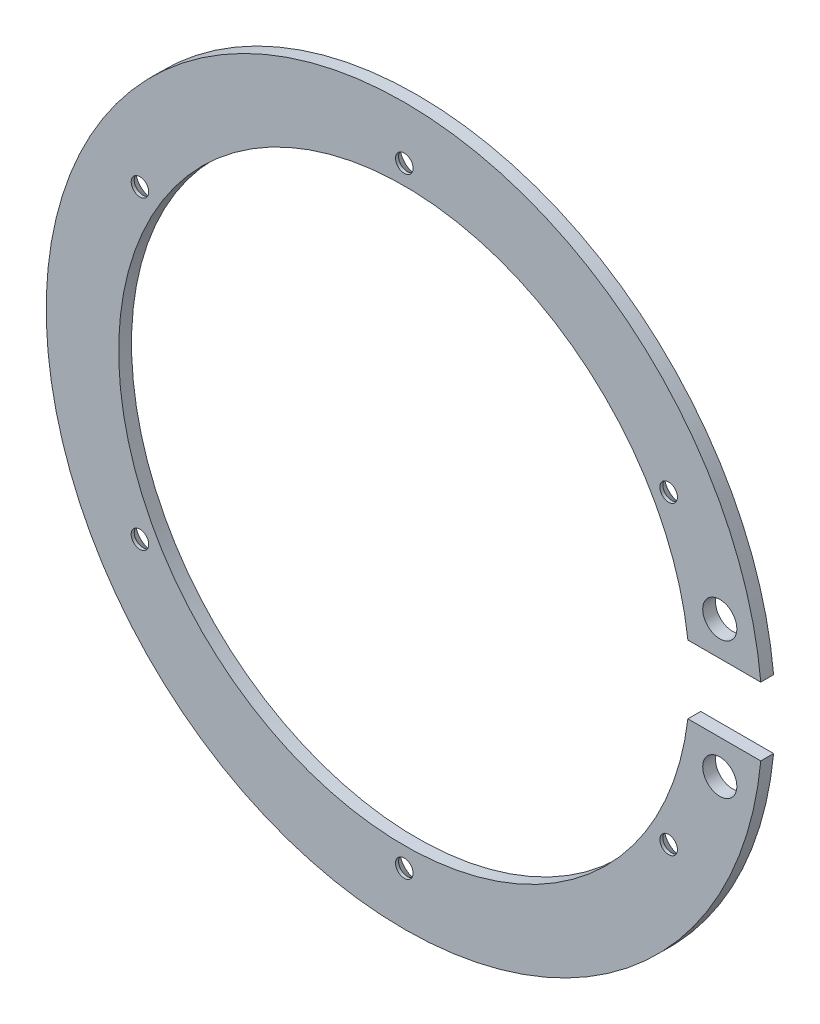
ISO-10303-21;
HEADER;
FILE_DESCRIPTION(('STEP AP214'),'2;1');
FILE_NAME('part.step','',(''),(''),'','','');
FILE_SCHEMA(('AUTOMOTIVE_DESIGN { 1 0 10303 214 1 1 1 1 }'));
ENDSEC;
DATA;
#1=APPLICATION_CONTEXT('core data for automotive mechanical design processes');
#2=APPLICATION_PROTOCOL_DEFINITION('international standard','automotive_design',2000,#1);
#3=PRODUCT_CONTEXT('',#1,'mechanical');
#4=PRODUCT('Part','Part','',(#3));
#5=PRODUCT_RELATED_PRODUCT_CATEGORY('part','',(#4));
#6=PRODUCT_DEFINITION_FORMATION('','',#4);
#7=PRODUCT_DEFINITION_CONTEXT('part definition',#1,'design');
#8=PRODUCT_DEFINITION('design','',#6,#7);
#9=PRODUCT_DEFINITION_SHAPE('','',#8);
#10=(LENGTH_UNIT() NAMED_UNIT(*) SI_UNIT(.MILLI.,.METRE.));
#11=(NAMED_UNIT(*) PLANE_ANGLE_UNIT() SI_UNIT($,.RADIAN.));
#12=(NAMED_UNIT(*) SI_UNIT($,.STERADIAN.) SOLID_ANGLE_UNIT());
#13=UNCERTAINTY_MEASURE_WITH_UNIT(LENGTH_MEASURE(1.E-05),#10,'distance_accuracy_value','');
#14=(GEOMETRIC_REPRESENTATION_CONTEXT(3) GLOBAL_UNCERTAINTY_ASSIGNED_CONTEXT((#13)) GLOBAL_UNIT_ASSIGNED_CONTEXT((#10,
#11,#12)) REPRESENTATION_CONTEXT('',''));
#15=CARTESIAN_POINT('',(0.,0.,0.));
#16=DIRECTION('',(0.,0.,1.));
#17=DIRECTION('',(1.,0.,0.));
#18=AXIS2_PLACEMENT_3D('',#15,#16,#17);
#19=CARTESIAN_POINT('',(0.,0.,0.));
#20=DIRECTION('',(0.,0.,1.));
#21=DIRECTION('',(1.,0.,0.));
#22=AXIS2_PLACEMENT_3D('',#19,#20,#21);
#23=PLANE('',#22);
#24=CARTESIAN_POINT('',(117.475,-25.4,0.));
#25=DIRECTION('',(0.,0.,-1.));
#26=DIRECTION('',(-1.,0.,0.));
#27=AXIS2_PLACEMENT_3D('',#24,#25,#26);
#28=CIRCLE('',#27,6.35);
#29=CARTESIAN_POINT('',(111.125,-25.4,0.));
#30=VERTEX_POINT('',#29);
#31=EDGE_CURVE('E169',#30,#30,#28,.T.);
#32=ORIENTED_EDGE('',*,*,#31,.F.);
#33=EDGE_LOOP('',(#32));
#34=FACE_BOUND('',#33,.T.);
#35=CARTESIAN_POINT('',(117.475,25.4,0.));
#36=DIRECTION('',(0.,0.,-1.));
#37=DIRECTION('',(-1.,0.,0.));
#38=AXIS2_PLACEMENT_3D('',#35,#36,#37);
#39=CIRCLE('',#38,6.35);
#40=CARTESIAN_POINT('',(111.125,25.4,0.));
#41=VERTEX_POINT('',#40);
#42=EDGE_CURVE('E163',#41,#41,#39,.T.);
#43=ORIENTED_EDGE('',*,*,#42,.F.);
#44=EDGE_LOOP('',(#43));
#45=FACE_BOUND('',#44,.T.);
#46=CARTESIAN_POINT('',(-98.4367775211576,56.8325000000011,0.));
#47=DIRECTION('',(0.,0.,-1.));
#48=DIRECTION('',(-1.,0.,0.));
#49=AXIS2_PLACEMENT_3D('',#46,#47,#48);
#50=CIRCLE('',#49,6.4389);
#51=CARTESIAN_POINT('',(-104.875677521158,56.8325000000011,0.));
#52=VERTEX_POINT('',#51);
#53=EDGE_CURVE('E150',#52,#52,#50,.T.);
#54=ORIENTED_EDGE('',*,*,#53,.F.);
#55=EDGE_LOOP('',(#54));
#56=FACE_BOUND('',#55,.T.);
#57=CARTESIAN_POINT('',(0.,-113.665,0.));
#58=DIRECTION('',(0.,0.,-1.));
#59=DIRECTION('',(-1.,0.,0.));
#60=AXIS2_PLACEMENT_3D('',#57,#58,#59);
#61=CIRCLE('',#60,6.4389);
#62=CARTESIAN_POINT('',(-6.4389,-113.665,0.));
#63=VERTEX_POINT('',#62);
#64=EDGE_CURVE('E132',#63,#63,#61,.T.);
#65=ORIENTED_EDGE('',*,*,#64,.F.);
#66=EDGE_LOOP('',(#65));
#67=FACE_BOUND('',#66,.T.);
#68=CARTESIAN_POINT('',(98.436777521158,-56.8325000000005,0.));
#69=DIRECTION('',(0.,0.,-1.));
#70=DIRECTION('',(-1.,0.,0.));
#71=AXIS2_PLACEMENT_3D('',#68,#69,#70);
#72=CIRCLE('',#71,6.4389);
#73=CARTESIAN_POINT('',(91.997877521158,-56.8325000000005,0.));
#74=VERTEX_POINT('',#73);
#75=EDGE_CURVE('E123',#74,#74,#72,.T.);
#76=ORIENTED_EDGE('',*,*,#75,.F.);
#77=EDGE_LOOP('',(#76));
#78=FACE_BOUND('',#77,.T.);
#79=CARTESIAN_POINT('',(98.4367775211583,56.8324999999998,0.));
#80=DIRECTION('',(0.,0.,-1.));
#81=DIRECTION('',(-1.,0.,0.));
#82=AXIS2_PLACEMENT_3D('',#79,#80,#81);
#83=CIRCLE('',#82,6.4389);
#84=CARTESIAN_POINT('',(91.9978775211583,56.8324999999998,0.));
#85=VERTEX_POINT('',#84);
#86=EDGE_CURVE('E114',#85,#85,#83,.T.);
#87=ORIENTED_EDGE('',*,*,#86,.F.);
#88=EDGE_LOOP('',(#87));
#89=FACE_BOUND('',#88,.T.);
#90=CARTESIAN_POINT('',(0.,113.665,0.));
#91=DIRECTION('',(0.,0.,-1.));
#92=DIRECTION('',(-1.,0.,0.));
#93=AXIS2_PLACEMENT_3D('',#90,#91,#92);
#94=CIRCLE('',#93,6.4389);
#95=CARTESIAN_POINT('',(-6.4389,113.665,0.));
#96=VERTEX_POINT('',#95);
#97=EDGE_CURVE('E105',#96,#96,#94,.T.);
#98=ORIENTED_EDGE('',*,*,#97,.F.);
#99=EDGE_LOOP('',(#98));
#100=FACE_BOUND('',#99,.T.);
#101=CARTESIAN_POINT('',(0.,0.,0.));
#102=DIRECTION('',(0.,0.,1.));
#103=DIRECTION('',(1.,0.,0.));
#104=AXIS2_PLACEMENT_3D('',#101,#102,#103);
#105=CIRCLE('',#104,133.35);
#106=CARTESIAN_POINT('',(132.74386049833,12.7,0.));
#107=VERTEX_POINT('',#106);
#108=CARTESIAN_POINT('',(132.74386049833,-12.7,0.));
#109=VERTEX_POINT('',#108);
#110=EDGE_CURVE('E40',#107,#109,#105,.T.);
#111=ORIENTED_EDGE('',*,*,#110,.F.);
#112=DIRECTION('',(1.,0.,0.));
#113=VECTOR('',#112,1.);
#114=CARTESIAN_POINT('',(133.35,12.7,0.));
#115=LINE('',#114,#113);
#116=CARTESIAN_POINT('',(105.601569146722,12.7,0.));
#117=VERTEX_POINT('',#116);
#118=EDGE_CURVE('E91',#117,#107,#115,.T.);
#119=ORIENTED_EDGE('',*,*,#118,.F.);
#120=CARTESIAN_POINT('',(0.,0.,0.));
#121=DIRECTION('',(0.,0.,1.));
#122=DIRECTION('',(1.,0.,0.));
#123=AXIS2_PLACEMENT_3D('',#120,#121,#122);
#124=CIRCLE('',#123,106.3625);
#125=CARTESIAN_POINT('',(105.601569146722,-12.7000000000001,0.));
#126=VERTEX_POINT('',#125);
#127=EDGE_CURVE('E94',#117,#126,#124,.T.);
#128=ORIENTED_EDGE('',*,*,#127,.T.);
#129=DIRECTION('',(-1.,0.,0.));
#130=VECTOR('',#129,1.);
#131=CARTESIAN_POINT('',(105.601569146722,-12.7,0.));
#132=LINE('',#131,#130);
#133=EDGE_CURVE('E51',#109,#126,#132,.T.);
#134=ORIENTED_EDGE('',*,*,#133,.F.);
#135=EDGE_LOOP('',(#111,#119,#128,#134));
#136=FACE_BOUND('',#135,.T.);
#137=CARTESIAN_POINT('',(-98.4367775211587,-56.8324999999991,0.));
#138=DIRECTION('',(0.,0.,-1.));
#139=DIRECTION('',(-1.,0.,0.));
#140=AXIS2_PLACEMENT_3D('',#137,#138,#139);
#141=CIRCLE('',#140,6.4389);
#142=CARTESIAN_POINT('',(-104.875677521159,-56.8324999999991,0.));
#143=VERTEX_POINT('',#142);
#144=EDGE_CURVE('E141',#143,#143,#141,.T.);
#145=ORIENTED_EDGE('',*,*,#144,.F.);
#146=EDGE_LOOP('',(#145));
#147=FACE_BOUND('',#146,.T.);
#148=ADVANCED_FACE('F36',(#34,#45,#56,#67,#78,#89,#100,#136,#147),#23,.F.);
#149=CARTESIAN_POINT('',(0.,0.,4.7752));
#150=DIRECTION('',(0.,0.,1.));
#151=DIRECTION('',(1.,0.,0.));
#152=AXIS2_PLACEMENT_3D('',#149,#150,#151);
#153=PLANE('',#152);
#154=CARTESIAN_POINT('',(117.475,-25.4,4.77520000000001));
#155=DIRECTION('',(0.,0.,-1.));
#156=DIRECTION('',(-1.,0.,0.));
#157=AXIS2_PLACEMENT_3D('',#154,#155,#156);
#158=CIRCLE('',#157,6.35);
#159=CARTESIAN_POINT('',(111.125,-25.4,4.77520000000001));
#160=VERTEX_POINT('',#159);
#161=EDGE_CURVE('E166',#160,#160,#158,.T.);
#162=ORIENTED_EDGE('',*,*,#161,.T.);
#163=EDGE_LOOP('',(#162));
#164=FACE_BOUND('',#163,.T.);
#165=CARTESIAN_POINT('',(117.475,25.4,4.77520000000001));
#166=DIRECTION('',(0.,0.,-1.));
#167=DIRECTION('',(-1.,0.,0.));
#168=AXIS2_PLACEMENT_3D('',#165,#166,#167);
#169=CIRCLE('',#168,6.35);
#170=CARTESIAN_POINT('',(111.125,25.4,4.77520000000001));
#171=VERTEX_POINT('',#170);
#172=EDGE_CURVE('E161',#171,#171,#169,.T.);
#173=ORIENTED_EDGE('',*,*,#172,.T.);
#174=EDGE_LOOP('',(#173));
#175=FACE_BOUND('',#174,.T.);
#176=DIRECTION('',(1.,0.,0.));
#177=VECTOR('',#176,1.);
#178=CARTESIAN_POINT('',(133.35,12.7,4.77520000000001));
#179=LINE('',#178,#177);
#180=CARTESIAN_POINT('',(105.601569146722,12.7,4.7752));
#181=VERTEX_POINT('',#180);
#182=CARTESIAN_POINT('',(132.74386049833,12.7,4.77520000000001));
#183=VERTEX_POINT('',#182);
#184=EDGE_CURVE('E59',#181,#183,#179,.T.);
#185=ORIENTED_EDGE('',*,*,#184,.T.);
#186=CARTESIAN_POINT('',(0.,0.,4.7752));
#187=DIRECTION('',(0.,0.,1.));
#188=DIRECTION('',(1.,0.,0.));
#189=AXIS2_PLACEMENT_3D('',#186,#187,#188);
#190=CIRCLE('',#189,133.35);
#191=CARTESIAN_POINT('',(132.74386049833,-12.7,4.77520000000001));
#192=VERTEX_POINT('',#191);
#193=EDGE_CURVE('E11',#183,#192,#190,.T.);
#194=ORIENTED_EDGE('',*,*,#193,.T.);
#195=DIRECTION('',(-1.,0.,0.));
#196=VECTOR('',#195,1.);
#197=CARTESIAN_POINT('',(105.601569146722,-12.7,4.77520000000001));
#198=LINE('',#197,#196);
#199=CARTESIAN_POINT('',(105.601569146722,-12.7,4.77520000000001));
#200=VERTEX_POINT('',#199);
#201=EDGE_CURVE('E77',#192,#200,#198,.T.);
#202=ORIENTED_EDGE('',*,*,#201,.T.);
#203=CARTESIAN_POINT('',(0.,0.,4.7752));
#204=DIRECTION('',(0.,0.,1.));
#205=DIRECTION('',(1.,0.,0.));
#206=AXIS2_PLACEMENT_3D('',#203,#204,#205);
#207=CIRCLE('',#206,106.3625);
#208=EDGE_CURVE('E89',#181,#200,#207,.T.);
#209=ORIENTED_EDGE('',*,*,#208,.F.);
#210=EDGE_LOOP('',(#185,#194,#202,#209));
#211=FACE_BOUND('',#210,.T.);
#212=CARTESIAN_POINT('',(-98.4367775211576,56.8325000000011,4.77520000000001));
#213=DIRECTION('',(0.,0.,-1.));
#214=DIRECTION('',(-1.,0.,0.));
#215=AXIS2_PLACEMENT_3D('',#212,#213,#214);
#216=CIRCLE('',#215,3.26389999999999);
#217=CARTESIAN_POINT('',(-101.700677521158,56.8325000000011,4.77520000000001));
#218=VERTEX_POINT('',#217);
#219=EDGE_CURVE('E144',#218,#218,#216,.T.);
#220=ORIENTED_EDGE('',*,*,#219,.T.);
#221=EDGE_LOOP('',(#220));
#222=FACE_BOUND('',#221,.T.);
#223=CARTESIAN_POINT('',(-98.4367775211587,-56.8324999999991,4.77520000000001));
#224=DIRECTION('',(0.,0.,-1.));
#225=DIRECTION('',(-1.,0.,0.));
#226=AXIS2_PLACEMENT_3D('',#223,#224,#225);
#227=CIRCLE('',#226,3.26389999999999);
#228=CARTESIAN_POINT('',(-101.700677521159,-56.8324999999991,4.77520000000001));
#229=VERTEX_POINT('',#228);
#230=EDGE_CURVE('E135',#229,#229,#227,.T.);
#231=ORIENTED_EDGE('',*,*,#230,.T.);
#232=EDGE_LOOP('',(#231));
#233=FACE_BOUND('',#232,.T.);
#234=CARTESIAN_POINT('',(0.,113.665,4.77520000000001));
#235=DIRECTION('',(0.,0.,-1.));
#236=DIRECTION('',(-1.,0.,0.));
#237=AXIS2_PLACEMENT_3D('',#234,#235,#236);
#238=CIRCLE('',#237,3.26389999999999);
#239=CARTESIAN_POINT('',(-3.26389999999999,113.665,4.77520000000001));
#240=VERTEX_POINT('',#239);
#241=EDGE_CURVE('E97',#240,#240,#238,.T.);
#242=ORIENTED_EDGE('',*,*,#241,.T.);
#243=EDGE_LOOP('',(#242));
#244=FACE_BOUND('',#243,.T.);
#245=CARTESIAN_POINT('',(98.4367775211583,56.8324999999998,4.77520000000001));
#246=DIRECTION('',(0.,0.,-1.));
#247=DIRECTION('',(-1.,0.,0.));
#248=AXIS2_PLACEMENT_3D('',#245,#246,#247);
#249=CIRCLE('',#248,3.26389999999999);
#250=CARTESIAN_POINT('',(95.1728775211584,56.8324999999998,4.77520000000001));
#251=VERTEX_POINT('',#250);
#252=EDGE_CURVE('E108',#251,#251,#249,.T.);
#253=ORIENTED_EDGE('',*,*,#252,.T.);
#254=EDGE_LOOP('',(#253));
#255=FACE_BOUND('',#254,.T.);
#256=CARTESIAN_POINT('',(98.436777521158,-56.8325000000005,4.77520000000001));
#257=DIRECTION('',(0.,0.,-1.));
#258=DIRECTION('',(-1.,0.,0.));
#259=AXIS2_PLACEMENT_3D('',#256,#257,#258);
#260=CIRCLE('',#259,3.26389999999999);
#261=CARTESIAN_POINT('',(95.172877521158,-56.8325000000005,4.77520000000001));
#262=VERTEX_POINT('',#261);
#263=EDGE_CURVE('E117',#262,#262,#260,.T.);
#264=ORIENTED_EDGE('',*,*,#263,.T.);
#265=EDGE_LOOP('',(#264));
#266=FACE_BOUND('',#265,.T.);
#267=CARTESIAN_POINT('',(0.,-113.665,4.77520000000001));
#268=DIRECTION('',(0.,0.,-1.));
#269=DIRECTION('',(-1.,0.,0.));
#270=AXIS2_PLACEMENT_3D('',#267,#268,#269);
#271=CIRCLE('',#270,3.26389999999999);
#272=CARTESIAN_POINT('',(-3.26389999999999,-113.665,4.77520000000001));
#273=VERTEX_POINT('',#272);
#274=EDGE_CURVE('E126',#273,#273,#271,.T.);
#275=ORIENTED_EDGE('',*,*,#274,.T.);
#276=EDGE_LOOP('',(#275));
#277=FACE_BOUND('',#276,.T.);
#278=ADVANCED_FACE('F87',(#164,#175,#211,#222,#233,#244,#255,#266,#277),#153,.T.);
#279=CARTESIAN_POINT('',(0.,0.,4.7752));
#280=DIRECTION('',(0.,0.,-1.));
#281=DIRECTION('',(-1.,0.,0.));
#282=AXIS2_PLACEMENT_3D('',#279,#280,#281);
#283=CYLINDRICAL_SURFACE('',#282,133.35);
#284=ORIENTED_EDGE('',*,*,#193,.F.);
#285=DIRECTION('',(0.,0.,-1.));
#286=VECTOR('',#285,1.);
#287=CARTESIAN_POINT('',(132.74386049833,12.7,4.7752));
#288=LINE('',#287,#286);
#289=EDGE_CURVE('E153',#183,#107,#288,.T.);
#290=ORIENTED_EDGE('',*,*,#289,.T.);
#291=ORIENTED_EDGE('',*,*,#110,.T.);
#292=DIRECTION('',(0.,0.,-1.));
#293=VECTOR('',#292,1.);
#294=CARTESIAN_POINT('',(132.74386049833,-12.7,4.7752));
#295=LINE('',#294,#293);
#296=EDGE_CURVE('E156',#109,#192,#295,.F.);
#297=ORIENTED_EDGE('',*,*,#296,.T.);
#298=EDGE_LOOP('',(#284,#290,#291,#297));
#299=FACE_BOUND('',#298,.T.);
#300=ADVANCED_FACE('F38',(#299),#283,.T.);
#301=CARTESIAN_POINT('',(0.,0.,4.7752));
#302=DIRECTION('',(0.,0.,-1.));
#303=DIRECTION('',(-1.,0.,0.));
#304=AXIS2_PLACEMENT_3D('',#301,#302,#303);
#305=CYLINDRICAL_SURFACE('',#304,106.3625);
#306=DIRECTION('',(0.,0.,-1.));
#307=VECTOR('',#306,1.);
#308=CARTESIAN_POINT('',(105.601569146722,12.7,4.77520000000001));
#309=LINE('',#308,#307);
#310=EDGE_CURVE('E83',#181,#117,#309,.T.);
#311=ORIENTED_EDGE('',*,*,#310,.F.);
#312=ORIENTED_EDGE('',*,*,#208,.T.);
#313=DIRECTION('',(0.,0.,-1.));
#314=VECTOR('',#313,1.);
#315=CARTESIAN_POINT('',(105.601569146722,-12.7,4.77520000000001));
#316=LINE('',#315,#314);
#317=EDGE_CURVE('E74',#200,#126,#316,.T.);
#318=ORIENTED_EDGE('',*,*,#317,.T.);
#319=ORIENTED_EDGE('',*,*,#127,.F.);
#320=EDGE_LOOP('',(#311,#312,#318,#319));
#321=FACE_BOUND('',#320,.T.);
#322=ADVANCED_FACE('F93',(#321),#305,.F.);
#323=CARTESIAN_POINT('',(0.,113.665,0.));
#324=DIRECTION('',(0.,0.,-1.));
#325=DIRECTION('',(-1.,0.,0.));
#326=AXIS2_PLACEMENT_3D('',#323,#324,#325);
#327=CYLINDRICAL_SURFACE('',#326,3.26389999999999);
#328=ORIENTED_EDGE('',*,*,#241,.F.);
#329=EDGE_LOOP('',(#328));
#330=FACE_BOUND('',#329,.T.);
#331=CARTESIAN_POINT('',(0.,113.665,3.65241969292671));
#332=DIRECTION('',(0.,0.,-1.));
#333=DIRECTION('',(-1.,0.,0.));
#334=AXIS2_PLACEMENT_3D('',#331,#332,#333);
#335=CIRCLE('',#334,3.26389999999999);
#336=CARTESIAN_POINT('',(-3.26389999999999,113.665,3.65241969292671));
#337=VERTEX_POINT('',#336);
#338=EDGE_CURVE('E102',#337,#337,#335,.T.);
#339=ORIENTED_EDGE('',*,*,#338,.T.);
#340=EDGE_LOOP('',(#339));
#341=FACE_BOUND('',#340,.T.);
#342=ADVANCED_FACE('F248',(#330,#341),#327,.F.);
#343=CARTESIAN_POINT('',(0.,113.665,0.));
#344=DIRECTION('',(0.,0.,-1.));
#345=DIRECTION('',(-1.,0.,0.));
#346=AXIS2_PLACEMENT_3D('',#343,#344,#345);
#347=CONICAL_SURFACE('',#346,6.4389,0.715584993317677);
#348=ORIENTED_EDGE('',*,*,#338,.F.);
#349=EDGE_LOOP('',(#348));
#350=FACE_BOUND('',#349,.T.);
#351=ORIENTED_EDGE('',*,*,#97,.T.);
#352=EDGE_LOOP('',(#351));
#353=FACE_BOUND('',#352,.T.);
#354=ADVANCED_FACE('F244',(#350,#353),#347,.F.);
#355=CARTESIAN_POINT('',(98.4367775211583,56.8324999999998,0.));
#356=DIRECTION('',(0.,0.,-1.));
#357=DIRECTION('',(-1.,0.,0.));
#358=AXIS2_PLACEMENT_3D('',#355,#356,#357);
#359=CYLINDRICAL_SURFACE('',#358,3.26389999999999);
#360=ORIENTED_EDGE('',*,*,#252,.F.);
#361=EDGE_LOOP('',(#360));
#362=FACE_BOUND('',#361,.T.);
#363=CARTESIAN_POINT('',(98.4367775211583,56.8324999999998,3.65241969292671));
#364=DIRECTION('',(0.,0.,-1.));
#365=DIRECTION('',(-1.,0.,0.));
#366=AXIS2_PLACEMENT_3D('',#363,#364,#365);
#367=CIRCLE('',#366,3.26389999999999);
#368=CARTESIAN_POINT('',(95.1728775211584,56.8324999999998,3.65241969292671));
#369=VERTEX_POINT('',#368);
#370=EDGE_CURVE('E111',#369,#369,#367,.T.);
#371=ORIENTED_EDGE('',*,*,#370,.T.);
#372=EDGE_LOOP('',(#371));
#373=FACE_BOUND('',#372,.T.);
#374=ADVANCED_FACE('F240',(#362,#373),#359,.F.);
#375=CARTESIAN_POINT('',(98.4367775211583,56.8324999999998,0.));
#376=DIRECTION('',(0.,0.,-1.));
#377=DIRECTION('',(-1.,0.,0.));
#378=AXIS2_PLACEMENT_3D('',#375,#376,#377);
#379=CONICAL_SURFACE('',#378,6.4389,0.715584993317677);
#380=ORIENTED_EDGE('',*,*,#370,.F.);
#381=EDGE_LOOP('',(#380));
#382=FACE_BOUND('',#381,.T.);
#383=ORIENTED_EDGE('',*,*,#86,.T.);
#384=EDGE_LOOP('',(#383));
#385=FACE_BOUND('',#384,.T.);
#386=ADVANCED_FACE('F236',(#382,#385),#379,.F.);
#387=CARTESIAN_POINT('',(98.436777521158,-56.8325000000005,0.));
#388=DIRECTION('',(0.,0.,-1.));
#389=DIRECTION('',(-1.,0.,0.));
#390=AXIS2_PLACEMENT_3D('',#387,#388,#389);
#391=CYLINDRICAL_SURFACE('',#390,3.26389999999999);
#392=ORIENTED_EDGE('',*,*,#263,.F.);
#393=EDGE_LOOP('',(#392));
#394=FACE_BOUND('',#393,.T.);
#395=CARTESIAN_POINT('',(98.436777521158,-56.8325000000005,3.65241969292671));
#396=DIRECTION('',(0.,0.,-1.));
#397=DIRECTION('',(-1.,0.,0.));
#398=AXIS2_PLACEMENT_3D('',#395,#396,#397);
#399=CIRCLE('',#398,3.26389999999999);
#400=CARTESIAN_POINT('',(95.172877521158,-56.8325000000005,3.65241969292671));
#401=VERTEX_POINT('',#400);
#402=EDGE_CURVE('E120',#401,#401,#399,.T.);
#403=ORIENTED_EDGE('',*,*,#402,.T.);
#404=EDGE_LOOP('',(#403));
#405=FACE_BOUND('',#404,.T.);
#406=ADVANCED_FACE('F232',(#394,#405),#391,.F.);
#407=CARTESIAN_POINT('',(98.436777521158,-56.8325000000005,0.));
#408=DIRECTION('',(0.,0.,-1.));
#409=DIRECTION('',(-1.,0.,0.));
#410=AXIS2_PLACEMENT_3D('',#407,#408,#409);
#411=CONICAL_SURFACE('',#410,6.4389,0.715584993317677);
#412=ORIENTED_EDGE('',*,*,#402,.F.);
#413=EDGE_LOOP('',(#412));
#414=FACE_BOUND('',#413,.T.);
#415=ORIENTED_EDGE('',*,*,#75,.T.);
#416=EDGE_LOOP('',(#415));
#417=FACE_BOUND('',#416,.T.);
#418=ADVANCED_FACE('F228',(#414,#417),#411,.F.);
#419=CARTESIAN_POINT('',(0.,-113.665,0.));
#420=DIRECTION('',(0.,0.,-1.));
#421=DIRECTION('',(-1.,0.,0.));
#422=AXIS2_PLACEMENT_3D('',#419,#420,#421);
#423=CYLINDRICAL_SURFACE('',#422,3.26389999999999);
#424=ORIENTED_EDGE('',*,*,#274,.F.);
#425=EDGE_LOOP('',(#424));
#426=FACE_BOUND('',#425,.T.);
#427=CARTESIAN_POINT('',(0.,-113.665,3.65241969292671));
#428=DIRECTION('',(0.,0.,-1.));
#429=DIRECTION('',(-1.,0.,0.));
#430=AXIS2_PLACEMENT_3D('',#427,#428,#429);
#431=CIRCLE('',#430,3.26389999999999);
#432=CARTESIAN_POINT('',(-3.26389999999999,-113.665,3.65241969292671));
#433=VERTEX_POINT('',#432);
#434=EDGE_CURVE('E129',#433,#433,#431,.T.);
#435=ORIENTED_EDGE('',*,*,#434,.T.);
#436=EDGE_LOOP('',(#435));
#437=FACE_BOUND('',#436,.T.);
#438=ADVANCED_FACE('F224',(#426,#437),#423,.F.);
#439=CARTESIAN_POINT('',(0.,-113.665,0.));
#440=DIRECTION('',(0.,0.,-1.));
#441=DIRECTION('',(-1.,0.,0.));
#442=AXIS2_PLACEMENT_3D('',#439,#440,#441);
#443=CONICAL_SURFACE('',#442,6.4389,0.715584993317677);
#444=ORIENTED_EDGE('',*,*,#434,.F.);
#445=EDGE_LOOP('',(#444));
#446=FACE_BOUND('',#445,.T.);
#447=ORIENTED_EDGE('',*,*,#64,.T.);
#448=EDGE_LOOP('',(#447));
#449=FACE_BOUND('',#448,.T.);
#450=ADVANCED_FACE('F216',(#446,#449),#443,.F.);
#451=CARTESIAN_POINT('',(-98.4367775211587,-56.8324999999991,0.));
#452=DIRECTION('',(0.,0.,-1.));
#453=DIRECTION('',(-1.,0.,0.));
#454=AXIS2_PLACEMENT_3D('',#451,#452,#453);
#455=CYLINDRICAL_SURFACE('',#454,3.26389999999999);
#456=ORIENTED_EDGE('',*,*,#230,.F.);
#457=EDGE_LOOP('',(#456));
#458=FACE_BOUND('',#457,.T.);
#459=CARTESIAN_POINT('',(-98.4367775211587,-56.8324999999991,3.65241969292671));
#460=DIRECTION('',(0.,0.,-1.));
#461=DIRECTION('',(-1.,0.,0.));
#462=AXIS2_PLACEMENT_3D('',#459,#460,#461);
#463=CIRCLE('',#462,3.26389999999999);
#464=CARTESIAN_POINT('',(-101.700677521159,-56.8324999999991,3.65241969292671));
#465=VERTEX_POINT('',#464);
#466=EDGE_CURVE('E138',#465,#465,#463,.T.);
#467=ORIENTED_EDGE('',*,*,#466,.T.);
#468=EDGE_LOOP('',(#467));
#469=FACE_BOUND('',#468,.T.);
#470=ADVANCED_FACE('F206',(#458,#469),#455,.F.);
#471=CARTESIAN_POINT('',(-98.4367775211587,-56.8324999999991,0.));
#472=DIRECTION('',(0.,0.,-1.));
#473=DIRECTION('',(-1.,0.,0.));
#474=AXIS2_PLACEMENT_3D('',#471,#472,#473);
#475=CONICAL_SURFACE('',#474,6.4389,0.715584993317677);
#476=ORIENTED_EDGE('',*,*,#466,.F.);
#477=EDGE_LOOP('',(#476));
#478=FACE_BOUND('',#477,.T.);
#479=ORIENTED_EDGE('',*,*,#144,.T.);
#480=EDGE_LOOP('',(#479));
#481=FACE_BOUND('',#480,.T.);
#482=ADVANCED_FACE('F203',(#478,#481),#475,.F.);
#483=CARTESIAN_POINT('',(-98.4367775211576,56.8325000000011,0.));
#484=DIRECTION('',(0.,0.,-1.));
#485=DIRECTION('',(-1.,0.,0.));
#486=AXIS2_PLACEMENT_3D('',#483,#484,#485);
#487=CYLINDRICAL_SURFACE('',#486,3.26389999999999);
#488=ORIENTED_EDGE('',*,*,#219,.F.);
#489=EDGE_LOOP('',(#488));
#490=FACE_BOUND('',#489,.T.);
#491=CARTESIAN_POINT('',(-98.4367775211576,56.8325000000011,3.65241969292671));
#492=DIRECTION('',(0.,0.,-1.));
#493=DIRECTION('',(-1.,0.,0.));
#494=AXIS2_PLACEMENT_3D('',#491,#492,#493);
#495=CIRCLE('',#494,3.26389999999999);
#496=CARTESIAN_POINT('',(-101.700677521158,56.8325000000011,3.65241969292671));
#497=VERTEX_POINT('',#496);
#498=EDGE_CURVE('E147',#497,#497,#495,.T.);
#499=ORIENTED_EDGE('',*,*,#498,.T.);
#500=EDGE_LOOP('',(#499));
#501=FACE_BOUND('',#500,.T.);
#502=ADVANCED_FACE('F205',(#490,#501),#487,.F.);
#503=CARTESIAN_POINT('',(-98.4367775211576,56.8325000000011,0.));
#504=DIRECTION('',(0.,0.,-1.));
#505=DIRECTION('',(-1.,0.,0.));
#506=AXIS2_PLACEMENT_3D('',#503,#504,#505);
#507=CONICAL_SURFACE('',#506,6.4389,0.715584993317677);
#508=ORIENTED_EDGE('',*,*,#498,.F.);
#509=EDGE_LOOP('',(#508));
#510=FACE_BOUND('',#509,.T.);
#511=ORIENTED_EDGE('',*,*,#53,.T.);
#512=EDGE_LOOP('',(#511));
#513=FACE_BOUND('',#512,.T.);
#514=ADVANCED_FACE('F213',(#510,#513),#507,.F.);
#515=CARTESIAN_POINT('',(105.601569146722,-12.7,4.77520000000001));
#516=DIRECTION('',(0.,-1.,0.));
#517=DIRECTION('',(1.,0.,0.));
#518=AXIS2_PLACEMENT_3D('',#515,#516,#517);
#519=PLANE('',#518);
#520=ORIENTED_EDGE('',*,*,#133,.T.);
#521=ORIENTED_EDGE('',*,*,#317,.F.);
#522=ORIENTED_EDGE('',*,*,#201,.F.);
#523=ORIENTED_EDGE('',*,*,#296,.F.);
#524=EDGE_LOOP('',(#520,#521,#522,#523));
#525=FACE_BOUND('',#524,.T.);
#526=ADVANCED_FACE('F76',(#525),#519,.F.);
#527=CARTESIAN_POINT('',(133.35,12.7,4.77520000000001));
#528=DIRECTION('',(0.,1.,0.));
#529=DIRECTION('',(-1.,0.,0.));
#530=AXIS2_PLACEMENT_3D('',#527,#528,#529);
#531=PLANE('',#530);
#532=ORIENTED_EDGE('',*,*,#184,.F.);
#533=ORIENTED_EDGE('',*,*,#310,.T.);
#534=ORIENTED_EDGE('',*,*,#118,.T.);
#535=ORIENTED_EDGE('',*,*,#289,.F.);
#536=EDGE_LOOP('',(#532,#533,#534,#535));
#537=FACE_BOUND('',#536,.T.);
#538=ADVANCED_FACE('F262',(#537),#531,.F.);
#539=CARTESIAN_POINT('',(117.475,25.4,4.77520000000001));
#540=DIRECTION('',(0.,0.,-1.));
#541=DIRECTION('',(-1.,0.,0.));
#542=AXIS2_PLACEMENT_3D('',#539,#540,#541);
#543=CYLINDRICAL_SURFACE('',#542,6.35);
#544=ORIENTED_EDGE('',*,*,#172,.F.);
#545=EDGE_LOOP('',(#544));
#546=FACE_BOUND('',#545,.T.);
#547=ORIENTED_EDGE('',*,*,#42,.T.);
#548=EDGE_LOOP('',(#547));
#549=FACE_BOUND('',#548,.T.);
#550=ADVANCED_FACE('F180',(#546,#549),#543,.F.);
#551=CARTESIAN_POINT('',(117.475,-25.4,4.77520000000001));
#552=DIRECTION('',(0.,0.,-1.));
#553=DIRECTION('',(-1.,0.,0.));
#554=AXIS2_PLACEMENT_3D('',#551,#552,#553);
#555=CYLINDRICAL_SURFACE('',#554,6.35);
#556=ORIENTED_EDGE('',*,*,#161,.F.);
#557=EDGE_LOOP('',(#556));
#558=FACE_BOUND('',#557,.T.);
#559=ORIENTED_EDGE('',*,*,#31,.T.);
#560=EDGE_LOOP('',(#559));
#561=FACE_BOUND('',#560,.T.);
#562=ADVANCED_FACE('F177',(#558,#561),#555,.F.);
#563=CLOSED_SHELL('',(#148,#278,#300,#322,#342,#354,#374,#386,#406,#418,#438,#450,#470,#482,
#502,#514,#526,#538,#550,#562));
#564=MANIFOLD_SOLID_BREP('B2',#563);
#565=ADVANCED_BREP_SHAPE_REPRESENTATION('',(#18,#564),#14);
#566=SHAPE_DEFINITION_REPRESENTATION(#9,#565);
ENDSEC;
END-ISO-10303-21;
